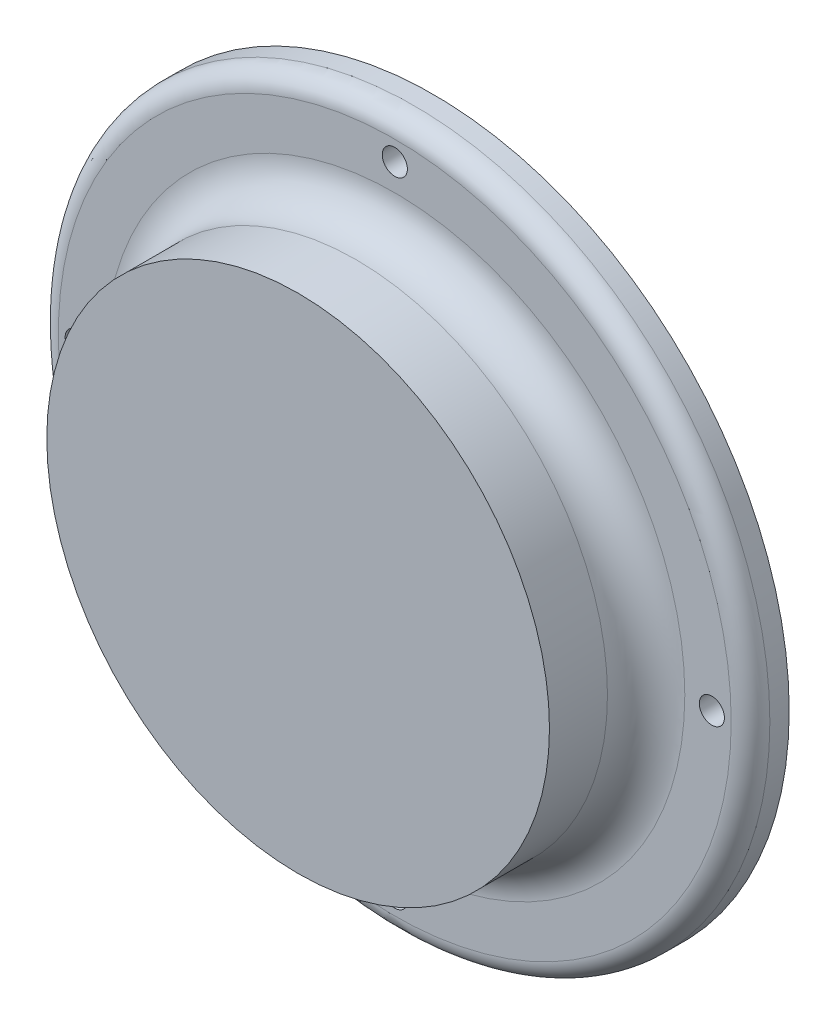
ISO-10303-21;
HEADER;
FILE_DESCRIPTION(('STEP AP214'),'2;1');
FILE_NAME('part.step','',(''),(''),'','','');
FILE_SCHEMA(('AUTOMOTIVE_DESIGN { 1 0 10303 214 1 1 1 1 }'));
ENDSEC;
DATA;
#1=APPLICATION_CONTEXT('core data for automotive mechanical design processes');
#2=APPLICATION_PROTOCOL_DEFINITION('international standard','automotive_design',2000,#1);
#3=PRODUCT_CONTEXT('',#1,'mechanical');
#4=PRODUCT('Part','Part','',(#3));
#5=PRODUCT_RELATED_PRODUCT_CATEGORY('part','',(#4));
#6=PRODUCT_DEFINITION_FORMATION('','',#4);
#7=PRODUCT_DEFINITION_CONTEXT('part definition',#1,'design');
#8=PRODUCT_DEFINITION('design','',#6,#7);
#9=PRODUCT_DEFINITION_SHAPE('','',#8);
#10=(LENGTH_UNIT() NAMED_UNIT(*) SI_UNIT(.MILLI.,.METRE.));
#11=(NAMED_UNIT(*) PLANE_ANGLE_UNIT() SI_UNIT($,.RADIAN.));
#12=(NAMED_UNIT(*) SI_UNIT($,.STERADIAN.) SOLID_ANGLE_UNIT());
#13=UNCERTAINTY_MEASURE_WITH_UNIT(LENGTH_MEASURE(1.E-05),#10,'distance_accuracy_value','');
#14=(GEOMETRIC_REPRESENTATION_CONTEXT(3) GLOBAL_UNCERTAINTY_ASSIGNED_CONTEXT((#13)) GLOBAL_UNIT_ASSIGNED_CONTEXT((#10,
#11,#12)) REPRESENTATION_CONTEXT('',''));
#15=CARTESIAN_POINT('',(0.,0.,0.));
#16=DIRECTION('',(0.,0.,1.));
#17=DIRECTION('',(1.,0.,0.));
#18=AXIS2_PLACEMENT_3D('',#15,#16,#17);
#19=CARTESIAN_POINT('',(0.,0.,10.));
#20=DIRECTION('',(0.,0.,1.));
#21=DIRECTION('',(1.,0.,0.));
#22=AXIS2_PLACEMENT_3D('',#19,#20,#21);
#23=PLANE('',#22);
#24=CARTESIAN_POINT('',(0.,0.,10.));
#25=DIRECTION('',(0.,0.,1.));
#26=DIRECTION('',(1.,0.,0.));
#27=AXIS2_PLACEMENT_3D('',#24,#25,#26);
#28=CIRCLE('',#27,75.);
#29=CARTESIAN_POINT('',(75.,0.,10.));
#30=VERTEX_POINT('',#29);
#31=EDGE_CURVE('E38',#30,#30,#28,.F.);
#32=ORIENTED_EDGE('',*,*,#31,.T.);
#33=EDGE_LOOP('',(#32));
#34=FACE_BOUND('',#33,.T.);
#35=CARTESIAN_POINT('',(0.,0.,10.));
#36=DIRECTION('',(0.,0.,1.));
#37=DIRECTION('',(1.,0.,0.));
#38=AXIS2_PLACEMENT_3D('',#35,#36,#37);
#39=CIRCLE('',#38,87.);
#40=CARTESIAN_POINT('',(87.,0.,10.));
#41=VERTEX_POINT('',#40);
#42=EDGE_CURVE('E50',#41,#41,#39,.T.);
#43=ORIENTED_EDGE('',*,*,#42,.T.);
#44=EDGE_LOOP('',(#43));
#45=FACE_BOUND('',#44,.T.);
#46=CARTESIAN_POINT('',(0.,81.9027362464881,10.));
#47=DIRECTION('',(0.,0.,1.));
#48=DIRECTION('',(1.,0.,0.));
#49=AXIS2_PLACEMENT_3D('',#46,#47,#48);
#50=CIRCLE('',#49,3.24999999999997);
#51=CARTESIAN_POINT('',(3.24999999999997,81.9027362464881,10.));
#52=VERTEX_POINT('',#51);
#53=EDGE_CURVE('E59',#52,#52,#50,.T.);
#54=ORIENTED_EDGE('',*,*,#53,.F.);
#55=EDGE_LOOP('',(#54));
#56=FACE_BOUND('',#55,.T.);
#57=CARTESIAN_POINT('',(-82.,-5.72603271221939E-13,10.));
#58=DIRECTION('',(0.,0.,1.));
#59=DIRECTION('',(1.,0.,0.));
#60=AXIS2_PLACEMENT_3D('',#57,#58,#59);
#61=CIRCLE('',#60,3.25000000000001);
#62=CARTESIAN_POINT('',(-78.75,-5.72603271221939E-13,10.));
#63=VERTEX_POINT('',#62);
#64=EDGE_CURVE('E65',#63,#63,#61,.T.);
#65=ORIENTED_EDGE('',*,*,#64,.F.);
#66=EDGE_LOOP('',(#65));
#67=FACE_BOUND('',#66,.T.);
#68=CARTESIAN_POINT('',(8.58904906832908E-13,-82.,10.));
#69=DIRECTION('',(0.,0.,1.));
#70=DIRECTION('',(1.,0.,0.));
#71=AXIS2_PLACEMENT_3D('',#68,#69,#70);
#72=CIRCLE('',#71,3.25);
#73=CARTESIAN_POINT('',(3.25000000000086,-82.,10.));
#74=VERTEX_POINT('',#73);
#75=EDGE_CURVE('E71',#74,#74,#72,.T.);
#76=ORIENTED_EDGE('',*,*,#75,.F.);
#77=EDGE_LOOP('',(#76));
#78=FACE_BOUND('',#77,.T.);
#79=CARTESIAN_POINT('',(82.,0.,10.));
#80=DIRECTION('',(0.,0.,1.));
#81=DIRECTION('',(1.,0.,0.));
#82=AXIS2_PLACEMENT_3D('',#79,#80,#81);
#83=CIRCLE('',#82,3.25000000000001);
#84=CARTESIAN_POINT('',(85.25,0.,10.));
#85=VERTEX_POINT('',#84);
#86=EDGE_CURVE('E77',#85,#85,#83,.T.);
#87=ORIENTED_EDGE('',*,*,#86,.F.);
#88=EDGE_LOOP('',(#87));
#89=FACE_BOUND('',#88,.T.);
#90=ADVANCED_FACE('F27',(#34,#45,#56,#67,#78,#89),#23,.T.);
#91=CARTESIAN_POINT('',(0.,0.,10.));
#92=DIRECTION('',(0.,0.,-1.));
#93=DIRECTION('',(-1.,0.,0.));
#94=AXIS2_PLACEMENT_3D('',#91,#92,#93);
#95=CYLINDRICAL_SURFACE('',#94,92.);
#96=CARTESIAN_POINT('',(0.,0.,5.));
#97=DIRECTION('',(0.,0.,1.));
#98=DIRECTION('',(1.,0.,0.));
#99=AXIS2_PLACEMENT_3D('',#96,#97,#98);
#100=CIRCLE('',#99,92.);
#101=CARTESIAN_POINT('',(92.,0.,5.));
#102=VERTEX_POINT('',#101);
#103=EDGE_CURVE('E47',#102,#102,#100,.F.);
#104=ORIENTED_EDGE('',*,*,#103,.T.);
#105=EDGE_LOOP('',(#104));
#106=FACE_BOUND('',#105,.T.);
#107=CARTESIAN_POINT('',(0.,0.,0.));
#108=DIRECTION('',(0.,0.,1.));
#109=DIRECTION('',(1.,0.,0.));
#110=AXIS2_PLACEMENT_3D('',#107,#108,#109);
#111=CIRCLE('',#110,92.);
#112=CARTESIAN_POINT('',(92.,0.,0.));
#113=VERTEX_POINT('',#112);
#114=EDGE_CURVE('E53',#113,#113,#111,.T.);
#115=ORIENTED_EDGE('',*,*,#114,.T.);
#116=EDGE_LOOP('',(#115));
#117=FACE_BOUND('',#116,.T.);
#118=ADVANCED_FACE('F29',(#106,#117),#95,.T.);
#119=CARTESIAN_POINT('',(0.,0.,0.));
#120=DIRECTION('',(0.,0.,1.));
#121=DIRECTION('',(1.,0.,0.));
#122=AXIS2_PLACEMENT_3D('',#119,#120,#121);
#123=PLANE('',#122);
#124=CARTESIAN_POINT('',(0.,0.,0.));
#125=DIRECTION('',(0.,0.,1.));
#126=DIRECTION('',(1.,0.,0.));
#127=AXIS2_PLACEMENT_3D('',#124,#125,#126);
#128=CIRCLE('',#127,69.);
#129=CARTESIAN_POINT('',(69.,0.,0.));
#130=VERTEX_POINT('',#129);
#131=EDGE_CURVE('E83',#130,#130,#128,.T.);
#132=ORIENTED_EDGE('',*,*,#131,.T.);
#133=EDGE_LOOP('',(#132));
#134=FACE_BOUND('',#133,.T.);
#135=CARTESIAN_POINT('',(82.,0.,0.));
#136=DIRECTION('',(0.,0.,1.));
#137=DIRECTION('',(1.,0.,0.));
#138=AXIS2_PLACEMENT_3D('',#135,#136,#137);
#139=CIRCLE('',#138,3.25000000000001);
#140=CARTESIAN_POINT('',(85.25,0.,0.));
#141=VERTEX_POINT('',#140);
#142=EDGE_CURVE('E74',#141,#141,#139,.T.);
#143=ORIENTED_EDGE('',*,*,#142,.T.);
#144=EDGE_LOOP('',(#143));
#145=FACE_BOUND('',#144,.T.);
#146=CARTESIAN_POINT('',(8.58904906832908E-13,-82.,0.));
#147=DIRECTION('',(0.,0.,1.));
#148=DIRECTION('',(1.,0.,0.));
#149=AXIS2_PLACEMENT_3D('',#146,#147,#148);
#150=CIRCLE('',#149,3.25);
#151=CARTESIAN_POINT('',(3.25000000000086,-82.,0.));
#152=VERTEX_POINT('',#151);
#153=EDGE_CURVE('E68',#152,#152,#150,.T.);
#154=ORIENTED_EDGE('',*,*,#153,.T.);
#155=EDGE_LOOP('',(#154));
#156=FACE_BOUND('',#155,.T.);
#157=CARTESIAN_POINT('',(-82.,-5.72603271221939E-13,0.));
#158=DIRECTION('',(0.,0.,1.));
#159=DIRECTION('',(1.,0.,0.));
#160=AXIS2_PLACEMENT_3D('',#157,#158,#159);
#161=CIRCLE('',#160,3.25000000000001);
#162=CARTESIAN_POINT('',(-78.75,-5.72603271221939E-13,0.));
#163=VERTEX_POINT('',#162);
#164=EDGE_CURVE('E62',#163,#163,#161,.T.);
#165=ORIENTED_EDGE('',*,*,#164,.T.);
#166=EDGE_LOOP('',(#165));
#167=FACE_BOUND('',#166,.T.);
#168=CARTESIAN_POINT('',(0.,81.9027362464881,0.));
#169=DIRECTION('',(0.,0.,1.));
#170=DIRECTION('',(1.,0.,0.));
#171=AXIS2_PLACEMENT_3D('',#168,#169,#170);
#172=CIRCLE('',#171,3.24999999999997);
#173=CARTESIAN_POINT('',(3.24999999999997,81.9027362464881,0.));
#174=VERTEX_POINT('',#173);
#175=EDGE_CURVE('E56',#174,#174,#172,.T.);
#176=ORIENTED_EDGE('',*,*,#175,.T.);
#177=EDGE_LOOP('',(#176));
#178=FACE_BOUND('',#177,.T.);
#179=ORIENTED_EDGE('',*,*,#114,.F.);
#180=EDGE_LOOP('',(#179));
#181=FACE_BOUND('',#180,.T.);
#182=ADVANCED_FACE('F87',(#134,#145,#156,#167,#178,#181),#123,.F.);
#183=CARTESIAN_POINT('',(0.,0.,5.));
#184=DIRECTION('',(0.,0.,1.));
#185=DIRECTION('',(1.,0.,0.));
#186=AXIS2_PLACEMENT_3D('',#183,#184,#185);
#187=TOROIDAL_SURFACE('',#186,87.,5.);
#188=ORIENTED_EDGE('',*,*,#103,.F.);
#189=EDGE_LOOP('',(#188));
#190=FACE_BOUND('',#189,.T.);
#191=ORIENTED_EDGE('',*,*,#42,.F.);
#192=EDGE_LOOP('',(#191));
#193=FACE_BOUND('',#192,.T.);
#194=ADVANCED_FACE('F114',(#190,#193),#187,.T.);
#195=CARTESIAN_POINT('',(0.,81.9027362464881,0.));
#196=DIRECTION('',(0.,0.,1.));
#197=DIRECTION('',(1.,0.,0.));
#198=AXIS2_PLACEMENT_3D('',#195,#196,#197);
#199=CYLINDRICAL_SURFACE('',#198,3.24999999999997);
#200=ORIENTED_EDGE('',*,*,#175,.F.);
#201=EDGE_LOOP('',(#200));
#202=FACE_BOUND('',#201,.T.);
#203=ORIENTED_EDGE('',*,*,#53,.T.);
#204=EDGE_LOOP('',(#203));
#205=FACE_BOUND('',#204,.T.);
#206=ADVANCED_FACE('F117',(#202,#205),#199,.F.);
#207=CARTESIAN_POINT('',(-82.,-5.72603271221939E-13,0.));
#208=DIRECTION('',(0.,0.,1.));
#209=DIRECTION('',(1.,0.,0.));
#210=AXIS2_PLACEMENT_3D('',#207,#208,#209);
#211=CYLINDRICAL_SURFACE('',#210,3.25000000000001);
#212=ORIENTED_EDGE('',*,*,#164,.F.);
#213=EDGE_LOOP('',(#212));
#214=FACE_BOUND('',#213,.T.);
#215=ORIENTED_EDGE('',*,*,#64,.T.);
#216=EDGE_LOOP('',(#215));
#217=FACE_BOUND('',#216,.T.);
#218=ADVANCED_FACE('F121',(#214,#217),#211,.F.);
#219=CARTESIAN_POINT('',(8.58904906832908E-13,-82.,0.));
#220=DIRECTION('',(0.,0.,1.));
#221=DIRECTION('',(1.,0.,0.));
#222=AXIS2_PLACEMENT_3D('',#219,#220,#221);
#223=CYLINDRICAL_SURFACE('',#222,3.25);
#224=ORIENTED_EDGE('',*,*,#153,.F.);
#225=EDGE_LOOP('',(#224));
#226=FACE_BOUND('',#225,.T.);
#227=ORIENTED_EDGE('',*,*,#75,.T.);
#228=EDGE_LOOP('',(#227));
#229=FACE_BOUND('',#228,.T.);
#230=ADVANCED_FACE('F125',(#226,#229),#223,.F.);
#231=CARTESIAN_POINT('',(82.,0.,0.));
#232=DIRECTION('',(0.,0.,1.));
#233=DIRECTION('',(1.,0.,0.));
#234=AXIS2_PLACEMENT_3D('',#231,#232,#233);
#235=CYLINDRICAL_SURFACE('',#234,3.25000000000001);
#236=ORIENTED_EDGE('',*,*,#142,.F.);
#237=EDGE_LOOP('',(#236));
#238=FACE_BOUND('',#237,.T.);
#239=ORIENTED_EDGE('',*,*,#86,.T.);
#240=EDGE_LOOP('',(#239));
#241=FACE_BOUND('',#240,.T.);
#242=ADVANCED_FACE('F129',(#238,#241),#235,.F.);
#243=CARTESIAN_POINT('',(0.,0.,35.));
#244=DIRECTION('',(0.,0.,-1.));
#245=DIRECTION('',(-1.,0.,0.));
#246=AXIS2_PLACEMENT_3D('',#243,#244,#245);
#247=CYLINDRICAL_SURFACE('',#246,65.);
#248=CARTESIAN_POINT('',(0.,0.,20.));
#249=DIRECTION('',(0.,0.,1.));
#250=DIRECTION('',(1.,0.,0.));
#251=AXIS2_PLACEMENT_3D('',#248,#249,#250);
#252=CIRCLE('',#251,65.);
#253=CARTESIAN_POINT('',(65.,0.,20.));
#254=VERTEX_POINT('',#253);
#255=EDGE_CURVE('E42',#254,#254,#252,.T.);
#256=ORIENTED_EDGE('',*,*,#255,.T.);
#257=EDGE_LOOP('',(#256));
#258=FACE_BOUND('',#257,.T.);
#259=CARTESIAN_POINT('',(0.,0.,35.));
#260=DIRECTION('',(0.,0.,1.));
#261=DIRECTION('',(1.,0.,0.));
#262=AXIS2_PLACEMENT_3D('',#259,#260,#261);
#263=CIRCLE('',#262,65.);
#264=CARTESIAN_POINT('',(65.,0.,35.));
#265=VERTEX_POINT('',#264);
#266=EDGE_CURVE('E80',#265,#265,#263,.T.);
#267=ORIENTED_EDGE('',*,*,#266,.F.);
#268=EDGE_LOOP('',(#267));
#269=FACE_BOUND('',#268,.T.);
#270=ADVANCED_FACE('F133',(#258,#269),#247,.T.);
#271=CARTESIAN_POINT('',(0.,0.,35.));
#272=DIRECTION('',(0.,0.,1.));
#273=DIRECTION('',(1.,0.,0.));
#274=AXIS2_PLACEMENT_3D('',#271,#272,#273);
#275=PLANE('',#274);
#276=ORIENTED_EDGE('',*,*,#266,.T.);
#277=EDGE_LOOP('',(#276));
#278=FACE_BOUND('',#277,.T.);
#279=ADVANCED_FACE('F101',(#278),#275,.T.);
#280=CARTESIAN_POINT('',(0.,0.,20.));
#281=DIRECTION('',(0.,0.,1.));
#282=DIRECTION('',(1.,0.,0.));
#283=AXIS2_PLACEMENT_3D('',#280,#281,#282);
#284=TOROIDAL_SURFACE('',#283,75.,10.);
#285=ORIENTED_EDGE('',*,*,#31,.F.);
#286=EDGE_LOOP('',(#285));
#287=FACE_BOUND('',#286,.T.);
#288=ORIENTED_EDGE('',*,*,#255,.F.);
#289=EDGE_LOOP('',(#288));
#290=FACE_BOUND('',#289,.T.);
#291=ADVANCED_FACE('F93',(#287,#290),#284,.F.);
#292=CARTESIAN_POINT('',(0.,0.,-7.));
#293=DIRECTION('',(0.,0.,1.));
#294=DIRECTION('',(1.,0.,0.));
#295=AXIS2_PLACEMENT_3D('',#292,#293,#294);
#296=CYLINDRICAL_SURFACE('',#295,69.);
#297=CARTESIAN_POINT('',(0.,0.,-5.49999999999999));
#298=DIRECTION('',(0.,0.,1.));
#299=DIRECTION('',(1.,0.,0.));
#300=AXIS2_PLACEMENT_3D('',#297,#298,#299);
#301=CIRCLE('',#300,69.);
#302=CARTESIAN_POINT('',(69.,0.,-5.49999999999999));
#303=VERTEX_POINT('',#302);
#304=EDGE_CURVE('E34',#303,#303,#301,.T.);
#305=ORIENTED_EDGE('',*,*,#304,.T.);
#306=EDGE_LOOP('',(#305));
#307=FACE_BOUND('',#306,.T.);
#308=ORIENTED_EDGE('',*,*,#131,.F.);
#309=EDGE_LOOP('',(#308));
#310=FACE_BOUND('',#309,.T.);
#311=ADVANCED_FACE('F90',(#307,#310),#296,.T.);
#312=CARTESIAN_POINT('',(0.,0.,-7.));
#313=DIRECTION('',(0.,0.,1.));
#314=DIRECTION('',(1.,0.,0.));
#315=AXIS2_PLACEMENT_3D('',#312,#313,#314);
#316=PLANE('',#315);
#317=CARTESIAN_POINT('',(0.,0.,-7.));
#318=DIRECTION('',(0.,0.,1.));
#319=DIRECTION('',(1.,0.,0.));
#320=AXIS2_PLACEMENT_3D('',#317,#318,#319);
#321=CIRCLE('',#320,67.5);
#322=CARTESIAN_POINT('',(67.5,0.,-7.));
#323=VERTEX_POINT('',#322);
#324=EDGE_CURVE('E10',#323,#323,#321,.F.);
#325=ORIENTED_EDGE('',*,*,#324,.T.);
#326=EDGE_LOOP('',(#325));
#327=FACE_BOUND('',#326,.T.);
#328=ADVANCED_FACE('F92',(#327),#316,.F.);
#329=CARTESIAN_POINT('',(0.,0.,-5.49999999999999));
#330=DIRECTION('',(0.,0.,1.));
#331=DIRECTION('',(1.,0.,0.));
#332=AXIS2_PLACEMENT_3D('',#329,#330,#331);
#333=CONICAL_SURFACE('',#332,69.,0.785398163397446);
#334=ORIENTED_EDGE('',*,*,#324,.F.);
#335=EDGE_LOOP('',(#334));
#336=FACE_BOUND('',#335,.T.);
#337=ORIENTED_EDGE('',*,*,#304,.F.);
#338=EDGE_LOOP('',(#337));
#339=FACE_BOUND('',#338,.T.);
#340=ADVANCED_FACE('F99',(#336,#339),#333,.T.);
#341=CLOSED_SHELL('',(#90,#118,#182,#194,#206,#218,#230,#242,#270,#279,#291,#311,#328,#340));
#342=MANIFOLD_SOLID_BREP('B2',#341);
#343=ADVANCED_BREP_SHAPE_REPRESENTATION('',(#18,#342),#14);
#344=SHAPE_DEFINITION_REPRESENTATION(#9,#343);
ENDSEC;
END-ISO-10303-21;
